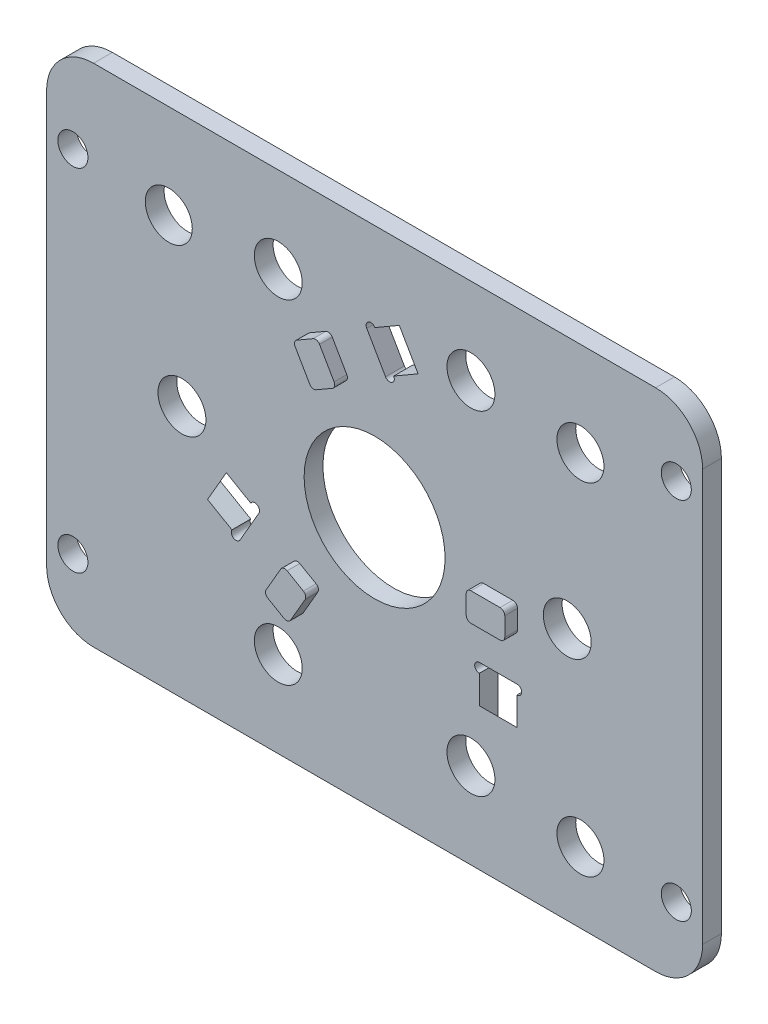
from build123d import *

# Parameters (mm, degrees)
SKETCH_1_W          = 76
SKETCH_1_H          = 60
EXTRUDE_1_DEPTH     = 2
EXTRUDE_2_DEPTH     = 3.35
SKETCH_2_W          = 76
SKETCH_2_H          = 60
CUT_EXTRUDE_1_DEPTH = 2.95
SKETCH_3_R          = 2.55
CUT_EXTRUDE_2_DEPTH = 45.193605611
SKETCH_4_R          = 7.5
CUT_EXTRUDE_3_DEPTH = 45.193605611
SKETCH_5_R          = 1.6
CUT_EXTRUDE_4_DEPTH = 45.193605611
SKETCH_6_R          = 2.5
CUT_EXTRUDE_5_DEPTH = 45.193605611
CUT_EXTRUDE_6_DEPTH = 4
CUT_EXTRUDE_7_DEPTH = 4
CUT_EXTRUDE_8_DEPTH = 4


with BuildPart() as part:
    # Sketch 1 → Extrude 1 (new body)
    with BuildSketch(Plane.XY):
        Rectangle(SKETCH_1_W, SKETCH_1_H)
        with BuildLine():
            ThreePointArc((-6.225922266, -9.22263808), (-5.992959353, -9.526241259), (-6.042909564, -9.905650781))
            Line((-6.042909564, -9.905650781), (-7.592909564, -12.590329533))
            ThreePointArc((-7.592909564, -12.590329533), (-7.896512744, -12.823292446), (-8.275922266, -12.773342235))
            Line((-8.275922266, -12.773342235), (-10.007973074, -11.773342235))
            ThreePointArc((-10.007973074, -11.773342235), (-10.240935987, -11.469739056), (-10.190985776, -11.090329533))
            Line((-10.190985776, -11.090329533), (-8.640985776, -8.405650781))
            ThreePointArc((-8.640985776, -8.405650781), (-8.337382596, -8.172687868), (-7.957973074, -8.22263808))
            Line((-7.957973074, -8.22263808), (-6.225922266, -9.22263808))
        make_face(mode=Mode.SUBTRACT)
        with BuildLine():
            Line((-12.313100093, -5.76593935), (-14.313100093, -9.230040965))
            ThreePointArc((-14.313100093, -9.230040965), (-14.996112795, -9.413053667), (-15.179125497, -8.730040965))
            Line((-15.179125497, -8.730040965), (-13.179125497, -5.26593935))
            ThreePointArc((-13.179125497, -5.26593935), (-12.496112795, -5.082926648), (-12.313100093, -5.76593935))
        make_face(mode=Mode.SUBTRACT)
        with BuildLine():
            ThreePointArc((11.15, -8.780487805), (10.65, -8.280487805), (11.15, -7.780487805))
            Line((11.15, -7.780487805), (15.15, -7.780487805))
            ThreePointArc((15.15, -7.780487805), (15.65, -8.280487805), (15.15, -8.780487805))
            Line((15.15, -8.780487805), (11.15, -8.780487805))
        make_face(mode=Mode.SUBTRACT)
        with BuildLine():
            Line((-5.557090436, 10.186138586), (-7.107090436, 12.870817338))
            ThreePointArc((-7.107090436, 12.870817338), (-7.157040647, 13.250226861), (-6.924077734, 13.55383004))
            Line((-6.924077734, 13.55383004), (-5.192026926, 14.55383004))
            ThreePointArc((-5.192026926, 14.55383004), (-4.812617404, 14.603780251), (-4.509014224, 14.370817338))
            Line((-4.509014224, 14.370817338), (-2.959014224, 11.686138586))
            ThreePointArc((-2.959014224, 11.686138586), (-2.909064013, 11.306729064), (-3.142026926, 11.003125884))
            Line((-3.142026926, 11.003125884), (-4.874077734, 10.003125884))
            ThreePointArc((-4.874077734, 10.003125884), (-5.253487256, 9.953175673), (-5.557090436, 10.186138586))
        make_face(mode=Mode.SUBTRACT)
        with BuildLine():
            Line((1.163100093, 13.546427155), (-0.836899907, 17.01052877))
            ThreePointArc((-0.836899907, 17.01052877), (-0.653887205, 17.693541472), (0.029125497, 17.51052877))
            Line((0.029125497, 17.51052877), (2.029125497, 14.046427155))
            ThreePointArc((2.029125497, 14.046427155), (1.846112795, 13.363414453), (1.163100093, 13.546427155))
        make_face(mode=Mode.SUBTRACT)
    extrude(amount=EXTRUDE_1_DEPTH)

    # Sketch 1_3 → Extrude 2 (add)
    with BuildSketch(Plane.XY):
        with BuildLine():
            Line((14.7, -0.280487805), (11.6, -0.280487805))
            ThreePointArc((11.6, -0.280487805), (11.246446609, -0.426934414), (11.1, -0.780487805))
            Line((11.1, -0.780487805), (11.1, -2.780487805))
            ThreePointArc((11.1, -2.780487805), (11.246446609, -3.134041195), (11.6, -3.280487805))
            Line((11.6, -3.280487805), (14.7, -3.280487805))
            ThreePointArc((14.7, -3.280487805), (15.053553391, -3.134041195), (15.2, -2.780487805))
            Line((15.2, -2.780487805), (15.2, -0.780487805))
            ThreePointArc((15.2, -0.780487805), (15.053553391, -0.426934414), (14.7, -0.280487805))
        make_face()
        with BuildLine():
            Line((-7.107090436, 12.870817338), (-5.557090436, 10.186138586))
            ThreePointArc((-5.557090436, 10.186138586), (-5.253487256, 9.953175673), (-4.874077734, 10.003125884))
            Line((-4.874077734, 10.003125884), (-3.142026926, 11.003125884))
            ThreePointArc((-3.142026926, 11.003125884), (-2.909064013, 11.306729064), (-2.959014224, 11.686138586))
            Line((-2.959014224, 11.686138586), (-4.509014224, 14.370817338))
            ThreePointArc((-4.509014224, 14.370817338), (-4.812617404, 14.603780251), (-5.192026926, 14.55383004))
            Line((-5.192026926, 14.55383004), (-6.924077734, 13.55383004))
            ThreePointArc((-6.924077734, 13.55383004), (-7.157040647, 13.250226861), (-7.107090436, 12.870817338))
        make_face()
        with BuildLine():
            Line((-6.042909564, -9.905650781), (-7.592909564, -12.590329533))
            ThreePointArc((-7.592909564, -12.590329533), (-7.896512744, -12.823292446), (-8.275922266, -12.773342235))
            Line((-8.275922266, -12.773342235), (-10.007973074, -11.773342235))
            ThreePointArc((-10.007973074, -11.773342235), (-10.240935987, -11.469739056), (-10.190985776, -11.090329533))
            Line((-10.190985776, -11.090329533), (-8.640985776, -8.405650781))
            ThreePointArc((-8.640985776, -8.405650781), (-8.337382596, -8.172687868), (-7.957973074, -8.22263808))
            Line((-7.957973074, -8.22263808), (-6.225922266, -9.22263808))
            ThreePointArc((-6.225922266, -9.22263808), (-5.992959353, -9.526241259), (-6.042909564, -9.905650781))
        make_face()
    extrude(amount=EXTRUDE_2_DEPTH)

    # Sketch 2 → Cut-Extrude 1 (cut)
    with BuildSketch(Plane(origin=(0, 0, 0), x_dir=(-1, 0, 0), z_dir=(0, 0, -1))):
        Rectangle(SKETCH_2_W, SKETCH_2_H)
        with BuildLine():
            ThreePointArc((-29.9, 26.904317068), (-33.435533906, 25.439850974), (-34.9, 21.904317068))
            Line((-34.9, 21.904317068), (-34.9, -21.9))
            ThreePointArc((-34.9, -21.9), (-33.435533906, -25.435533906), (-29.9, -26.9))
            Line((-29.9, -26.9), (29.9, -26.9))
            ThreePointArc((29.9, -26.9), (33.435533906, -25.435533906), (34.9, -21.9))
            Line((34.9, -21.9), (34.9, 21.904317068))
            ThreePointArc((34.9, 21.904317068), (33.435533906, 25.439850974), (29.9, 26.904317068))
            Line((29.9, 26.904317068), (-29.9, 26.904317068))
        make_face(mode=Mode.SUBTRACT)
    extrude(amount=-CUT_EXTRUDE_1_DEPTH, mode=Mode.SUBTRACT)

    # Sketch 3 → Cut-Extrude 2 (cut, through all)
    with BuildSketch(Plane(origin=(0, 0, 0), x_dir=(-1, 0, 0), z_dir=(0, 0, -1))):
        with Locations((20.5, 0)):
            Circle(SKETCH_3_R)
        with Locations((-20.5, 0)):
            Circle(SKETCH_3_R)
        with Locations((-10.25, -17.753520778)):
            Circle(SKETCH_3_R)
        with Locations((-10.25, 17.753520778)):
            Circle(SKETCH_3_R)
        with Locations((10.25, 17.753520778)):
            Circle(SKETCH_3_R)
        with Locations((10.25, -17.753520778)):
            Circle(SKETCH_3_R)
    extrude(amount=-CUT_EXTRUDE_2_DEPTH, mode=Mode.SUBTRACT)

    # Sketch 4 → Cut-Extrude 3 (cut, through all)
    with BuildSketch(Plane(origin=(0, 0, 0), x_dir=(-1, 0, 0), z_dir=(0, 0, -1))):
        Circle(SKETCH_4_R)
    extrude(amount=-CUT_EXTRUDE_3_DEPTH, mode=Mode.SUBTRACT)

    # Sketch 5 → Cut-Extrude 4 (cut, through all)
    with BuildSketch(Plane(origin=(0, 0, 0), x_dir=(-1, 0, 0), z_dir=(0, 0, -1))):
        with Locations((-32.1, 19.404317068)):
            Circle(SKETCH_5_R)
        with Locations(Location((-32.102400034, -19.400346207, 0), (0, 0, 180))):
            Circle(SKETCH_5_R)
        with Locations((32.102400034, -19.400346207)):
            Circle(SKETCH_5_R)
        with Locations((32.102400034, 17.904317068)):
            Circle(SKETCH_5_R)
    extrude(amount=-CUT_EXTRUDE_4_DEPTH, mode=Mode.SUBTRACT)

    # Sketch 6 → Cut-Extrude 5 (cut, through all)
    with BuildSketch(Plane(origin=(0, 0, 0), x_dir=(-1, 0, 0), z_dir=(0, 0, -1))):
        with Locations((-21.9, 16.904317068)):
            Circle(SKETCH_6_R)
        with Locations(Location((21.9, 16.904317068, 0), (0, 0, 180))):
            Circle(SKETCH_6_R)
        with Locations((-21.9, -19.4)):
            Circle(SKETCH_6_R)
    extrude(amount=-CUT_EXTRUDE_5_DEPTH, mode=Mode.SUBTRACT)

    # Sketch 7 → Cut-Extrude 6 (cut)
    with BuildSketch(Plane.ZY.offset(-11.15)):
        Polygon((2, -8.780487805), (0, -8.780487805), (0, -13.780487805), (2, -11.780487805), align=None)
    extrude(amount=-CUT_EXTRUDE_6_DEPTH, mode=Mode.SUBTRACT)

    # Sketch 8 → Cut-Extrude 7 (cut)
    with BuildSketch(Plane(origin=(-5.575, 9.656183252, 0), x_dir=(-0.8660254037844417, -0.4999999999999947, 0), z_dir=(0.49999999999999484, -0.8660254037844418, 0))):
        Polygon((-8.780487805, -2), (-8.780487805, 0), (-13.780487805, 0), (-11.780487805, -2), align=None)
    extrude(amount=-CUT_EXTRUDE_7_DEPTH, mode=Mode.SUBTRACT)

    # Sketch 9 → Cut-Extrude 8 (cut)
    with BuildSketch(Plane(origin=(-5.575, -9.656183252, 0), x_dir=(0.8660254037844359, -0.5000000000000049, 0), z_dir=(0.5000000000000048, 0.8660254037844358, 0))):
        Polygon((-8.780487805, -2), (-8.780487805, 0), (-13.780487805, 0), (-11.780487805, -2), align=None)
    extrude(amount=-CUT_EXTRUDE_8_DEPTH, mode=Mode.SUBTRACT)


solid = part.part
